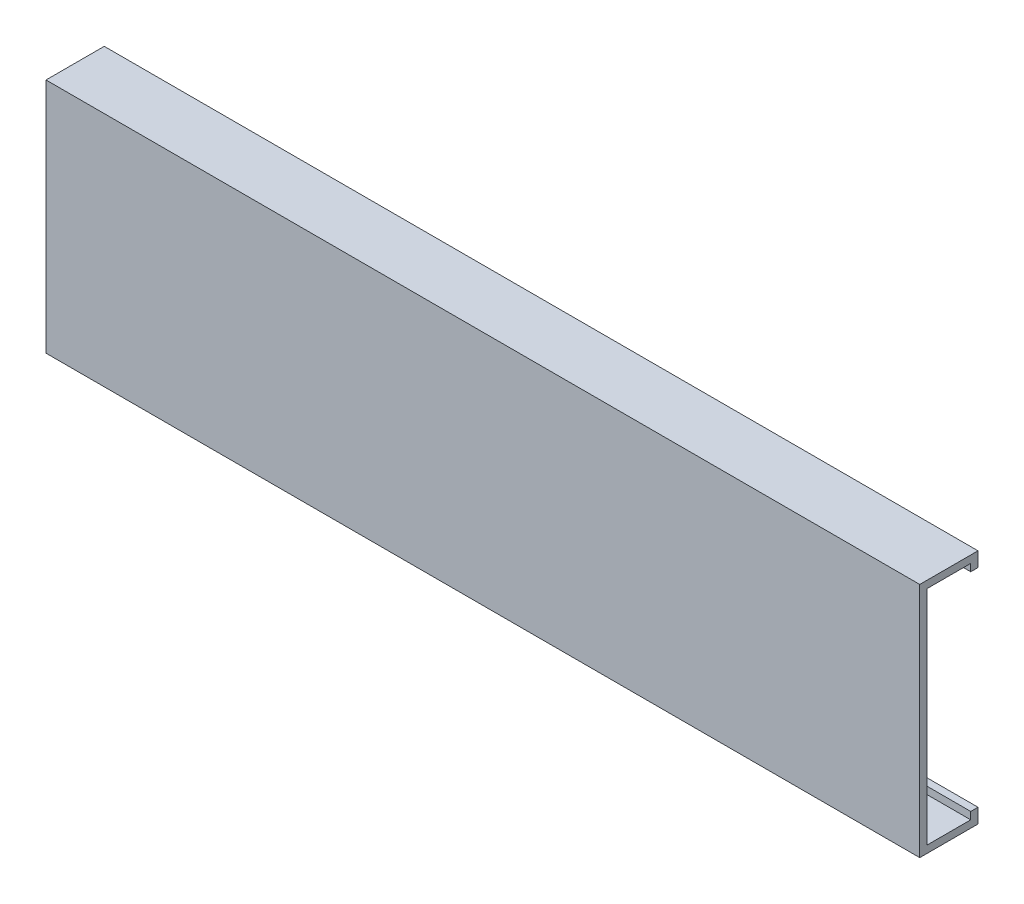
ISO-10303-21;
HEADER;
FILE_DESCRIPTION(('STEP AP214'),'2;1');
FILE_NAME('part.step','',(''),(''),'','','');
FILE_SCHEMA(('AUTOMOTIVE_DESIGN { 1 0 10303 214 1 1 1 1 }'));
ENDSEC;
DATA;
#1=APPLICATION_CONTEXT('core data for automotive mechanical design processes');
#2=APPLICATION_PROTOCOL_DEFINITION('international standard','automotive_design',2000,#1);
#3=PRODUCT_CONTEXT('',#1,'mechanical');
#4=PRODUCT('Part','Part','',(#3));
#5=PRODUCT_RELATED_PRODUCT_CATEGORY('part','',(#4));
#6=PRODUCT_DEFINITION_FORMATION('','',#4);
#7=PRODUCT_DEFINITION_CONTEXT('part definition',#1,'design');
#8=PRODUCT_DEFINITION('design','',#6,#7);
#9=PRODUCT_DEFINITION_SHAPE('','',#8);
#10=(LENGTH_UNIT() NAMED_UNIT(*) SI_UNIT(.MILLI.,.METRE.));
#11=(NAMED_UNIT(*) PLANE_ANGLE_UNIT() SI_UNIT($,.RADIAN.));
#12=(NAMED_UNIT(*) SI_UNIT($,.STERADIAN.) SOLID_ANGLE_UNIT());
#13=UNCERTAINTY_MEASURE_WITH_UNIT(LENGTH_MEASURE(1.E-05),#10,'distance_accuracy_value','');
#14=(GEOMETRIC_REPRESENTATION_CONTEXT(3) GLOBAL_UNCERTAINTY_ASSIGNED_CONTEXT((#13)) GLOBAL_UNIT_ASSIGNED_CONTEXT((#10,
#11,#12)) REPRESENTATION_CONTEXT('',''));
#15=CARTESIAN_POINT('',(0.,0.,0.));
#16=DIRECTION('',(0.,0.,1.));
#17=DIRECTION('',(1.,0.,0.));
#18=AXIS2_PLACEMENT_3D('',#15,#16,#17);
#19=CARTESIAN_POINT('',(0.,-15.75,0.));
#20=DIRECTION('',(0.,-1.,0.));
#21=DIRECTION('',(0.,0.,-1.));
#22=AXIS2_PLACEMENT_3D('',#19,#20,#21);
#23=PLANE('',#22);
#24=DIRECTION('',(1.,0.,0.));
#25=VECTOR('',#24,1.);
#26=CARTESIAN_POINT('',(-60.,-15.75,-6.));
#27=LINE('',#26,#25);
#28=CARTESIAN_POINT('',(-60.,-15.75,-6.));
#29=VERTEX_POINT('',#28);
#30=CARTESIAN_POINT('',(60.,-15.75,-6.));
#31=VERTEX_POINT('',#30);
#32=EDGE_CURVE('E148',#29,#31,#27,.T.);
#33=ORIENTED_EDGE('',*,*,#32,.F.);
#34=DIRECTION('',(0.,0.,-1.));
#35=VECTOR('',#34,1.);
#36=CARTESIAN_POINT('',(-60.,-15.75,1.));
#37=LINE('',#36,#35);
#38=CARTESIAN_POINT('',(-60.,-15.75,0.));
#39=VERTEX_POINT('',#38);
#40=EDGE_CURVE('E153',#39,#29,#37,.T.);
#41=ORIENTED_EDGE('',*,*,#40,.F.);
#42=DIRECTION('',(1.,0.,0.));
#43=VECTOR('',#42,1.);
#44=CARTESIAN_POINT('',(-60.,-15.75,0.));
#45=LINE('',#44,#43);
#46=CARTESIAN_POINT('',(60.,-15.75,0.));
#47=VERTEX_POINT('',#46);
#48=EDGE_CURVE('E211',#39,#47,#45,.T.);
#49=ORIENTED_EDGE('',*,*,#48,.T.);
#50=DIRECTION('',(0.,0.,1.));
#51=VECTOR('',#50,1.);
#52=CARTESIAN_POINT('',(60.,-15.75,1.));
#53=LINE('',#52,#51);
#54=EDGE_CURVE('E155',#31,#47,#53,.T.);
#55=ORIENTED_EDGE('',*,*,#54,.F.);
#56=EDGE_LOOP('',(#33,#41,#49,#55));
#57=FACE_BOUND('',#56,.T.);
#58=ADVANCED_FACE('F38',(#57),#23,.F.);
#59=CARTESIAN_POINT('',(0.,14.75,0.));
#60=DIRECTION('',(0.,-1.,0.));
#61=DIRECTION('',(0.,0.,-1.));
#62=AXIS2_PLACEMENT_3D('',#59,#60,#61);
#63=PLANE('',#62);
#64=DIRECTION('',(0.,0.,1.));
#65=VECTOR('',#64,1.);
#66=CARTESIAN_POINT('',(-60.,14.75,0.));
#67=LINE('',#66,#65);
#68=CARTESIAN_POINT('',(-60.,14.75,-6.));
#69=VERTEX_POINT('',#68);
#70=CARTESIAN_POINT('',(-60.,14.75,0.));
#71=VERTEX_POINT('',#70);
#72=EDGE_CURVE('E193',#69,#71,#67,.T.);
#73=ORIENTED_EDGE('',*,*,#72,.F.);
#74=DIRECTION('',(-1.,0.,0.));
#75=VECTOR('',#74,1.);
#76=CARTESIAN_POINT('',(-60.,14.75,-6.));
#77=LINE('',#76,#75);
#78=CARTESIAN_POINT('',(60.,14.75,-6.));
#79=VERTEX_POINT('',#78);
#80=EDGE_CURVE('E176',#79,#69,#77,.T.);
#81=ORIENTED_EDGE('',*,*,#80,.F.);
#82=DIRECTION('',(0.,0.,-1.));
#83=VECTOR('',#82,1.);
#84=CARTESIAN_POINT('',(60.,14.75,0.));
#85=LINE('',#84,#83);
#86=CARTESIAN_POINT('',(60.,14.75,0.));
#87=VERTEX_POINT('',#86);
#88=EDGE_CURVE('E60',#87,#79,#85,.T.);
#89=ORIENTED_EDGE('',*,*,#88,.F.);
#90=DIRECTION('',(1.,0.,0.));
#91=VECTOR('',#90,1.);
#92=CARTESIAN_POINT('',(-60.,14.75,0.));
#93=LINE('',#92,#91);
#94=EDGE_CURVE('E195',#71,#87,#93,.T.);
#95=ORIENTED_EDGE('',*,*,#94,.F.);
#96=EDGE_LOOP('',(#73,#81,#89,#95));
#97=FACE_BOUND('',#96,.T.);
#98=ADVANCED_FACE('F237',(#97),#63,.T.);
#99=CARTESIAN_POINT('',(0.,0.,0.));
#100=DIRECTION('',(0.,0.,-1.));
#101=DIRECTION('',(-1.,0.,0.));
#102=AXIS2_PLACEMENT_3D('',#99,#100,#101);
#103=PLANE('',#102);
#104=DIRECTION('',(0.,-1.,0.));
#105=VECTOR('',#104,1.);
#106=CARTESIAN_POINT('',(-60.,-15.75,0.));
#107=LINE('',#106,#105);
#108=EDGE_CURVE('E217',#71,#39,#107,.T.);
#109=ORIENTED_EDGE('',*,*,#108,.F.);
#110=ORIENTED_EDGE('',*,*,#94,.T.);
#111=DIRECTION('',(0.,1.,0.));
#112=VECTOR('',#111,1.);
#113=CARTESIAN_POINT('',(60.,-15.75,0.));
#114=LINE('',#113,#112);
#115=EDGE_CURVE('E204',#47,#87,#114,.T.);
#116=ORIENTED_EDGE('',*,*,#115,.F.);
#117=ORIENTED_EDGE('',*,*,#48,.F.);
#118=EDGE_LOOP('',(#109,#110,#116,#117));
#119=FACE_BOUND('',#118,.T.);
#120=ADVANCED_FACE('F242',(#119),#103,.T.);
#121=CARTESIAN_POINT('',(60.,-15.75,1.));
#122=DIRECTION('',(-1.,0.,0.));
#123=DIRECTION('',(0.,0.,1.));
#124=AXIS2_PLACEMENT_3D('',#121,#122,#123);
#125=PLANE('',#124);
#126=ORIENTED_EDGE('',*,*,#115,.T.);
#127=ORIENTED_EDGE('',*,*,#88,.T.);
#128=DIRECTION('',(0.,1.,0.));
#129=VECTOR('',#128,1.);
#130=CARTESIAN_POINT('',(60.,13.75,-6.));
#131=LINE('',#130,#129);
#132=CARTESIAN_POINT('',(60.,13.75,-6.));
#133=VERTEX_POINT('',#132);
#134=EDGE_CURVE('E53',#133,#79,#131,.T.);
#135=ORIENTED_EDGE('',*,*,#134,.F.);
#136=DIRECTION('',(0.,0.,1.));
#137=VECTOR('',#136,1.);
#138=CARTESIAN_POINT('',(60.,13.75,-7.));
#139=LINE('',#138,#137);
#140=CARTESIAN_POINT('',(60.,13.75,-7.));
#141=VERTEX_POINT('',#140);
#142=EDGE_CURVE('E183',#141,#133,#139,.T.);
#143=ORIENTED_EDGE('',*,*,#142,.F.);
#144=DIRECTION('',(0.,1.,0.));
#145=VECTOR('',#144,1.);
#146=CARTESIAN_POINT('',(60.,14.75,-7.));
#147=LINE('',#146,#145);
#148=CARTESIAN_POINT('',(60.,15.75,-7.));
#149=VERTEX_POINT('',#148);
#150=EDGE_CURVE('E198',#141,#149,#147,.T.);
#151=ORIENTED_EDGE('',*,*,#150,.T.);
#152=DIRECTION('',(0.,0.,-1.));
#153=VECTOR('',#152,1.);
#154=CARTESIAN_POINT('',(60.,15.75,1.));
#155=LINE('',#154,#153);
#156=CARTESIAN_POINT('',(60.,15.75,1.));
#157=VERTEX_POINT('',#156);
#158=EDGE_CURVE('E11',#157,#149,#155,.T.);
#159=ORIENTED_EDGE('',*,*,#158,.F.);
#160=DIRECTION('',(0.,1.,0.));
#161=VECTOR('',#160,1.);
#162=CARTESIAN_POINT('',(60.,-15.75,1.));
#163=LINE('',#162,#161);
#164=CARTESIAN_POINT('',(60.,-16.75,1.));
#165=VERTEX_POINT('',#164);
#166=EDGE_CURVE('E207',#165,#157,#163,.T.);
#167=ORIENTED_EDGE('',*,*,#166,.F.);
#168=DIRECTION('',(0.,0.,1.));
#169=VECTOR('',#168,1.);
#170=CARTESIAN_POINT('',(60.,-16.75,1.));
#171=LINE('',#170,#169);
#172=CARTESIAN_POINT('',(60.,-16.75,-7.));
#173=VERTEX_POINT('',#172);
#174=EDGE_CURVE('E165',#173,#165,#171,.T.);
#175=ORIENTED_EDGE('',*,*,#174,.F.);
#176=DIRECTION('',(0.,1.,0.));
#177=VECTOR('',#176,1.);
#178=CARTESIAN_POINT('',(60.,-16.75,-7.));
#179=LINE('',#178,#177);
#180=CARTESIAN_POINT('',(60.,-14.75,-7.));
#181=VERTEX_POINT('',#180);
#182=EDGE_CURVE('E170',#173,#181,#179,.T.);
#183=ORIENTED_EDGE('',*,*,#182,.T.);
#184=DIRECTION('',(0.,0.,-1.));
#185=VECTOR('',#184,1.);
#186=CARTESIAN_POINT('',(60.,-14.75,-7.));
#187=LINE('',#186,#185);
#188=CARTESIAN_POINT('',(60.,-14.75,-6.));
#189=VERTEX_POINT('',#188);
#190=EDGE_CURVE('E138',#189,#181,#187,.T.);
#191=ORIENTED_EDGE('',*,*,#190,.F.);
#192=DIRECTION('',(0.,-1.,0.));
#193=VECTOR('',#192,1.);
#194=CARTESIAN_POINT('',(60.,-14.75,-6.));
#195=LINE('',#194,#193);
#196=EDGE_CURVE('E134',#189,#31,#195,.T.);
#197=ORIENTED_EDGE('',*,*,#196,.T.);
#198=ORIENTED_EDGE('',*,*,#54,.T.);
#199=EDGE_LOOP('',(#126,#127,#135,#143,#151,#159,#167,#175,#183,#191,#197,#198));
#200=FACE_BOUND('',#199,.T.);
#201=ADVANCED_FACE('F40',(#200),#125,.F.);
#202=CARTESIAN_POINT('',(-60.,15.75,1.));
#203=DIRECTION('',(0.,-1.,0.));
#204=DIRECTION('',(0.,0.,-1.));
#205=AXIS2_PLACEMENT_3D('',#202,#203,#204);
#206=PLANE('',#205);
#207=ORIENTED_EDGE('',*,*,#158,.T.);
#208=DIRECTION('',(-1.,0.,0.));
#209=VECTOR('',#208,1.);
#210=CARTESIAN_POINT('',(-60.,15.75,-7.));
#211=LINE('',#210,#209);
#212=CARTESIAN_POINT('',(-60.,15.75,-7.));
#213=VERTEX_POINT('',#212);
#214=EDGE_CURVE('E192',#149,#213,#211,.T.);
#215=ORIENTED_EDGE('',*,*,#214,.T.);
#216=DIRECTION('',(0.,0.,-1.));
#217=VECTOR('',#216,1.);
#218=CARTESIAN_POINT('',(-60.,15.75,1.));
#219=LINE('',#218,#217);
#220=CARTESIAN_POINT('',(-60.,15.75,1.));
#221=VERTEX_POINT('',#220);
#222=EDGE_CURVE('E46',#221,#213,#219,.T.);
#223=ORIENTED_EDGE('',*,*,#222,.F.);
#224=DIRECTION('',(-1.,0.,0.));
#225=VECTOR('',#224,1.);
#226=CARTESIAN_POINT('',(-60.,15.75,1.));
#227=LINE('',#226,#225);
#228=EDGE_CURVE('E210',#157,#221,#227,.T.);
#229=ORIENTED_EDGE('',*,*,#228,.F.);
#230=EDGE_LOOP('',(#207,#215,#223,#229));
#231=FACE_BOUND('',#230,.T.);
#232=ADVANCED_FACE('F229',(#231),#206,.F.);
#233=CARTESIAN_POINT('',(-60.,-15.75,1.));
#234=DIRECTION('',(1.,0.,0.));
#235=DIRECTION('',(0.,0.,-1.));
#236=AXIS2_PLACEMENT_3D('',#233,#234,#235);
#237=PLANE('',#236);
#238=ORIENTED_EDGE('',*,*,#222,.T.);
#239=DIRECTION('',(0.,1.,0.));
#240=VECTOR('',#239,1.);
#241=CARTESIAN_POINT('',(-60.,14.75,-7.));
#242=LINE('',#241,#240);
#243=CARTESIAN_POINT('',(-60.,13.75,-7.));
#244=VERTEX_POINT('',#243);
#245=EDGE_CURVE('E201',#244,#213,#242,.T.);
#246=ORIENTED_EDGE('',*,*,#245,.F.);
#247=DIRECTION('',(0.,0.,-1.));
#248=VECTOR('',#247,1.);
#249=CARTESIAN_POINT('',(-60.,13.75,-7.));
#250=LINE('',#249,#248);
#251=CARTESIAN_POINT('',(-60.,13.75,-6.));
#252=VERTEX_POINT('',#251);
#253=EDGE_CURVE('E177',#252,#244,#250,.T.);
#254=ORIENTED_EDGE('',*,*,#253,.F.);
#255=DIRECTION('',(0.,1.,0.));
#256=VECTOR('',#255,1.);
#257=CARTESIAN_POINT('',(-60.,13.75,-6.));
#258=LINE('',#257,#256);
#259=EDGE_CURVE('E187',#252,#69,#258,.T.);
#260=ORIENTED_EDGE('',*,*,#259,.T.);
#261=ORIENTED_EDGE('',*,*,#72,.T.);
#262=ORIENTED_EDGE('',*,*,#108,.T.);
#263=ORIENTED_EDGE('',*,*,#40,.T.);
#264=DIRECTION('',(0.,-1.,0.));
#265=VECTOR('',#264,1.);
#266=CARTESIAN_POINT('',(-60.,-14.75,-6.));
#267=LINE('',#266,#265);
#268=CARTESIAN_POINT('',(-60.,-14.75,-6.));
#269=VERTEX_POINT('',#268);
#270=EDGE_CURVE('E131',#269,#29,#267,.T.);
#271=ORIENTED_EDGE('',*,*,#270,.F.);
#272=DIRECTION('',(0.,0.,1.));
#273=VECTOR('',#272,1.);
#274=CARTESIAN_POINT('',(-60.,-14.75,-7.));
#275=LINE('',#274,#273);
#276=CARTESIAN_POINT('',(-60.,-14.75,-7.));
#277=VERTEX_POINT('',#276);
#278=EDGE_CURVE('E139',#277,#269,#275,.T.);
#279=ORIENTED_EDGE('',*,*,#278,.F.);
#280=DIRECTION('',(0.,1.,0.));
#281=VECTOR('',#280,1.);
#282=CARTESIAN_POINT('',(-60.,-16.75,-7.));
#283=LINE('',#282,#281);
#284=CARTESIAN_POINT('',(-60.,-16.75,-7.));
#285=VERTEX_POINT('',#284);
#286=EDGE_CURVE('E174',#285,#277,#283,.T.);
#287=ORIENTED_EDGE('',*,*,#286,.F.);
#288=DIRECTION('',(0.,0.,-1.));
#289=VECTOR('',#288,1.);
#290=CARTESIAN_POINT('',(-60.,-16.75,1.));
#291=LINE('',#290,#289);
#292=CARTESIAN_POINT('',(-60.,-16.75,1.));
#293=VERTEX_POINT('',#292);
#294=EDGE_CURVE('E160',#293,#285,#291,.T.);
#295=ORIENTED_EDGE('',*,*,#294,.F.);
#296=DIRECTION('',(0.,-1.,0.));
#297=VECTOR('',#296,1.);
#298=CARTESIAN_POINT('',(-60.,-15.75,1.));
#299=LINE('',#298,#297);
#300=EDGE_CURVE('E213',#221,#293,#299,.T.);
#301=ORIENTED_EDGE('',*,*,#300,.F.);
#302=EDGE_LOOP('',(#238,#246,#254,#260,#261,#262,#263,#271,#279,#287,#295,#301));
#303=FACE_BOUND('',#302,.T.);
#304=ADVANCED_FACE('F151',(#303),#237,.F.);
#305=CARTESIAN_POINT('',(0.,0.,1.));
#306=DIRECTION('',(0.,0.,-1.));
#307=DIRECTION('',(-1.,0.,0.));
#308=AXIS2_PLACEMENT_3D('',#305,#306,#307);
#309=PLANE('',#308);
#310=ORIENTED_EDGE('',*,*,#166,.T.);
#311=ORIENTED_EDGE('',*,*,#228,.T.);
#312=ORIENTED_EDGE('',*,*,#300,.T.);
#313=DIRECTION('',(-1.,0.,0.));
#314=VECTOR('',#313,1.);
#315=CARTESIAN_POINT('',(-60.,-16.75,1.));
#316=LINE('',#315,#314);
#317=EDGE_CURVE('E168',#165,#293,#316,.T.);
#318=ORIENTED_EDGE('',*,*,#317,.F.);
#319=EDGE_LOOP('',(#310,#311,#312,#318));
#320=FACE_BOUND('',#319,.T.);
#321=ADVANCED_FACE('F255',(#320),#309,.F.);
#322=CARTESIAN_POINT('',(-60.,14.75,-7.));
#323=DIRECTION('',(0.,0.,-1.));
#324=DIRECTION('',(-1.,0.,0.));
#325=AXIS2_PLACEMENT_3D('',#322,#323,#324);
#326=PLANE('',#325);
#327=ORIENTED_EDGE('',*,*,#214,.F.);
#328=ORIENTED_EDGE('',*,*,#150,.F.);
#329=DIRECTION('',(1.,0.,0.));
#330=VECTOR('',#329,1.);
#331=CARTESIAN_POINT('',(-60.,13.75,-7.));
#332=LINE('',#331,#330);
#333=EDGE_CURVE('E180',#244,#141,#332,.T.);
#334=ORIENTED_EDGE('',*,*,#333,.F.);
#335=ORIENTED_EDGE('',*,*,#245,.T.);
#336=EDGE_LOOP('',(#327,#328,#334,#335));
#337=FACE_BOUND('',#336,.T.);
#338=ADVANCED_FACE('F228',(#337),#326,.T.);
#339=CARTESIAN_POINT('',(-60.,13.75,-6.));
#340=DIRECTION('',(0.,0.,-1.));
#341=DIRECTION('',(-1.,0.,0.));
#342=AXIS2_PLACEMENT_3D('',#339,#340,#341);
#343=PLANE('',#342);
#344=ORIENTED_EDGE('',*,*,#80,.T.);
#345=ORIENTED_EDGE('',*,*,#259,.F.);
#346=DIRECTION('',(-1.,0.,0.));
#347=VECTOR('',#346,1.);
#348=CARTESIAN_POINT('',(-60.,13.75,-6.));
#349=LINE('',#348,#347);
#350=EDGE_CURVE('E185',#133,#252,#349,.T.);
#351=ORIENTED_EDGE('',*,*,#350,.F.);
#352=ORIENTED_EDGE('',*,*,#134,.T.);
#353=EDGE_LOOP('',(#344,#345,#351,#352));
#354=FACE_BOUND('',#353,.T.);
#355=ADVANCED_FACE('F263',(#354),#343,.F.);
#356=CARTESIAN_POINT('',(0.,13.75,0.));
#357=DIRECTION('',(0.,1.,0.));
#358=DIRECTION('',(0.,0.,1.));
#359=AXIS2_PLACEMENT_3D('',#356,#357,#358);
#360=PLANE('',#359);
#361=ORIENTED_EDGE('',*,*,#253,.T.);
#362=ORIENTED_EDGE('',*,*,#333,.T.);
#363=ORIENTED_EDGE('',*,*,#142,.T.);
#364=ORIENTED_EDGE('',*,*,#350,.T.);
#365=EDGE_LOOP('',(#361,#362,#363,#364));
#366=FACE_BOUND('',#365,.T.);
#367=ADVANCED_FACE('F234',(#366),#360,.F.);
#368=CARTESIAN_POINT('',(-60.,-16.75,-7.));
#369=DIRECTION('',(0.,0.,1.));
#370=DIRECTION('',(1.,0.,0.));
#371=AXIS2_PLACEMENT_3D('',#368,#369,#370);
#372=PLANE('',#371);
#373=ORIENTED_EDGE('',*,*,#286,.T.);
#374=DIRECTION('',(-1.,0.,0.));
#375=VECTOR('',#374,1.);
#376=CARTESIAN_POINT('',(-60.,-14.75,-7.));
#377=LINE('',#376,#375);
#378=EDGE_CURVE('E145',#181,#277,#377,.T.);
#379=ORIENTED_EDGE('',*,*,#378,.F.);
#380=ORIENTED_EDGE('',*,*,#182,.F.);
#381=DIRECTION('',(1.,0.,0.));
#382=VECTOR('',#381,1.);
#383=CARTESIAN_POINT('',(-60.,-16.75,-7.));
#384=LINE('',#383,#382);
#385=EDGE_CURVE('E163',#285,#173,#384,.T.);
#386=ORIENTED_EDGE('',*,*,#385,.F.);
#387=EDGE_LOOP('',(#373,#379,#380,#386));
#388=FACE_BOUND('',#387,.T.);
#389=ADVANCED_FACE('F249',(#388),#372,.F.);
#390=CARTESIAN_POINT('',(0.,-16.75,0.));
#391=DIRECTION('',(0.,-1.,0.));
#392=DIRECTION('',(0.,0.,-1.));
#393=AXIS2_PLACEMENT_3D('',#390,#391,#392);
#394=PLANE('',#393);
#395=ORIENTED_EDGE('',*,*,#294,.T.);
#396=ORIENTED_EDGE('',*,*,#385,.T.);
#397=ORIENTED_EDGE('',*,*,#174,.T.);
#398=ORIENTED_EDGE('',*,*,#317,.T.);
#399=EDGE_LOOP('',(#395,#396,#397,#398));
#400=FACE_BOUND('',#399,.T.);
#401=ADVANCED_FACE('F252',(#400),#394,.T.);
#402=CARTESIAN_POINT('',(-60.,-14.75,-6.));
#403=DIRECTION('',(0.,0.,-1.));
#404=DIRECTION('',(-1.,0.,0.));
#405=AXIS2_PLACEMENT_3D('',#402,#403,#404);
#406=PLANE('',#405);
#407=ORIENTED_EDGE('',*,*,#32,.T.);
#408=ORIENTED_EDGE('',*,*,#196,.F.);
#409=DIRECTION('',(1.,0.,0.));
#410=VECTOR('',#409,1.);
#411=CARTESIAN_POINT('',(-60.,-14.75,-6.));
#412=LINE('',#411,#410);
#413=EDGE_CURVE('E127',#269,#189,#412,.T.);
#414=ORIENTED_EDGE('',*,*,#413,.F.);
#415=ORIENTED_EDGE('',*,*,#270,.T.);
#416=EDGE_LOOP('',(#407,#408,#414,#415));
#417=FACE_BOUND('',#416,.T.);
#418=ADVANCED_FACE('F129',(#417),#406,.F.);
#419=CARTESIAN_POINT('',(0.,-14.75,0.));
#420=DIRECTION('',(0.,1.,0.));
#421=DIRECTION('',(0.,0.,1.));
#422=AXIS2_PLACEMENT_3D('',#419,#420,#421);
#423=PLANE('',#422);
#424=ORIENTED_EDGE('',*,*,#278,.T.);
#425=ORIENTED_EDGE('',*,*,#413,.T.);
#426=ORIENTED_EDGE('',*,*,#190,.T.);
#427=ORIENTED_EDGE('',*,*,#378,.T.);
#428=EDGE_LOOP('',(#424,#425,#426,#427));
#429=FACE_BOUND('',#428,.T.);
#430=ADVANCED_FACE('F143',(#429),#423,.T.);
#431=CLOSED_SHELL('',(#58,#98,#120,#201,#232,#304,#321,#338,#355,#367,#389,#401,#418,#430));
#432=MANIFOLD_SOLID_BREP('B2',#431);
#433=ADVANCED_BREP_SHAPE_REPRESENTATION('',(#18,#432),#14);
#434=SHAPE_DEFINITION_REPRESENTATION(#9,#433);
ENDSEC;
END-ISO-10303-21;
